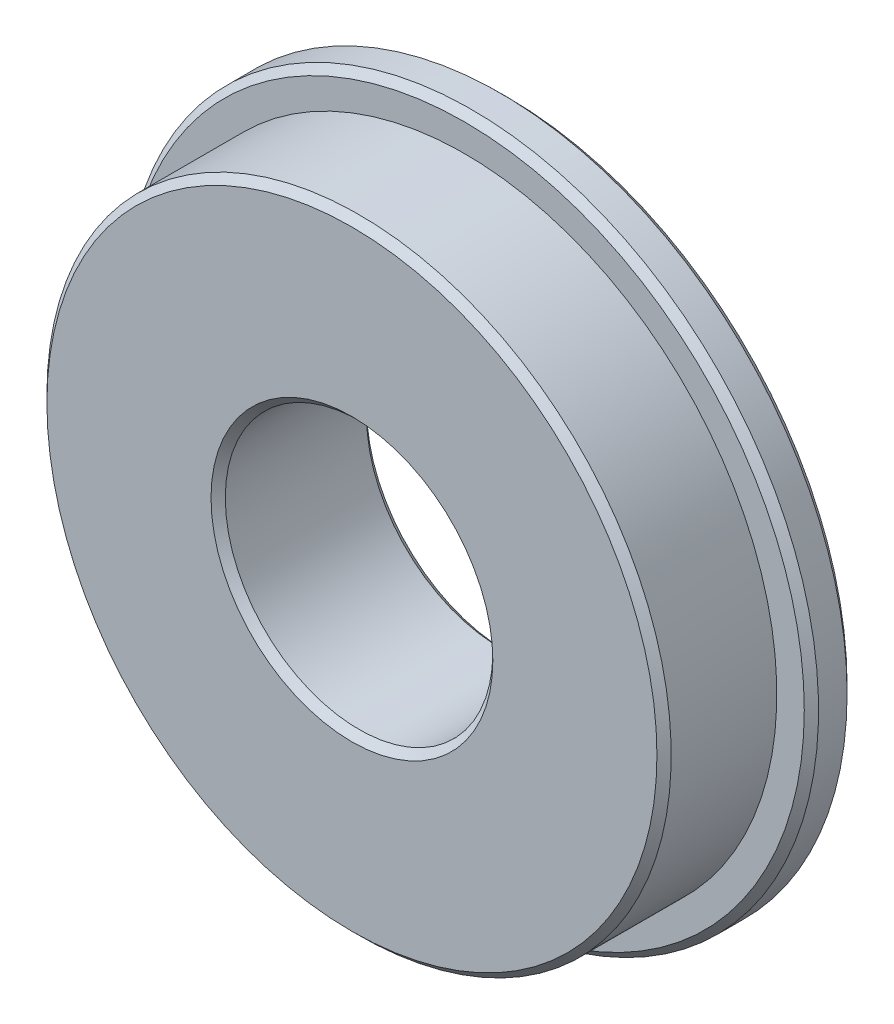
ISO-10303-21;
HEADER;
FILE_DESCRIPTION(('STEP AP214'),'2;1');
FILE_NAME('part.step','',(''),(''),'','','');
FILE_SCHEMA(('AUTOMOTIVE_DESIGN { 1 0 10303 214 1 1 1 1 }'));
ENDSEC;
DATA;
#1=APPLICATION_CONTEXT('core data for automotive mechanical design processes');
#2=APPLICATION_PROTOCOL_DEFINITION('international standard','automotive_design',2000,#1);
#3=PRODUCT_CONTEXT('',#1,'mechanical');
#4=PRODUCT('Part','Part','',(#3));
#5=PRODUCT_RELATED_PRODUCT_CATEGORY('part','',(#4));
#6=PRODUCT_DEFINITION_FORMATION('','',#4);
#7=PRODUCT_DEFINITION_CONTEXT('part definition',#1,'design');
#8=PRODUCT_DEFINITION('design','',#6,#7);
#9=PRODUCT_DEFINITION_SHAPE('','',#8);
#10=(LENGTH_UNIT() NAMED_UNIT(*) SI_UNIT(.MILLI.,.METRE.));
#11=(NAMED_UNIT(*) PLANE_ANGLE_UNIT() SI_UNIT($,.RADIAN.));
#12=(NAMED_UNIT(*) SI_UNIT($,.STERADIAN.) SOLID_ANGLE_UNIT());
#13=UNCERTAINTY_MEASURE_WITH_UNIT(LENGTH_MEASURE(1.E-05),#10,'distance_accuracy_value','');
#14=(GEOMETRIC_REPRESENTATION_CONTEXT(3) GLOBAL_UNCERTAINTY_ASSIGNED_CONTEXT((#13)) GLOBAL_UNIT_ASSIGNED_CONTEXT((#10,
#11,#12)) REPRESENTATION_CONTEXT('',''));
#15=CARTESIAN_POINT('',(0.,0.,0.));
#16=DIRECTION('',(0.,0.,1.));
#17=DIRECTION('',(1.,0.,0.));
#18=AXIS2_PLACEMENT_3D('',#15,#16,#17);
#19=CARTESIAN_POINT('',(-8.86153846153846,6.04195804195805,5.28319999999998));
#20=DIRECTION('',(0.,0.,-1.));
#21=DIRECTION('',(-1.,0.,0.));
#22=AXIS2_PLACEMENT_3D('',#19,#20,#21);
#23=CONICAL_SURFACE('',#22,11.1125,0.78539816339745);
#24=CARTESIAN_POINT('',(-8.86153846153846,6.04195804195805,5.2832));
#25=DIRECTION('',(0.,0.,-1.));
#26=DIRECTION('',(-1.,0.,0.));
#27=AXIS2_PLACEMENT_3D('',#24,#25,#26);
#28=CIRCLE('',#27,11.1125);
#29=CARTESIAN_POINT('',(-19.9740384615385,6.04195804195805,5.2832));
#30=VERTEX_POINT('',#29);
#31=EDGE_CURVE('E44',#30,#30,#28,.T.);
#32=ORIENTED_EDGE('',*,*,#31,.F.);
#33=EDGE_LOOP('',(#32));
#34=FACE_BOUND('',#33,.T.);
#35=CARTESIAN_POINT('',(-8.86153846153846,6.04195804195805,5.53719999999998));
#36=DIRECTION('',(0.,0.,-1.));
#37=DIRECTION('',(-1.,0.,0.));
#38=AXIS2_PLACEMENT_3D('',#35,#36,#37);
#39=CIRCLE('',#38,10.8585);
#40=CARTESIAN_POINT('',(-19.7200384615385,6.04195804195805,5.53719999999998));
#41=VERTEX_POINT('',#40);
#42=EDGE_CURVE('E18',#41,#41,#39,.T.);
#43=ORIENTED_EDGE('',*,*,#42,.T.);
#44=EDGE_LOOP('',(#43));
#45=FACE_BOUND('',#44,.T.);
#46=ADVANCED_FACE('F15',(#34,#45),#23,.T.);
#47=CARTESIAN_POINT('',(-8.86153846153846,6.04195804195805,5.5372));
#48=DIRECTION('',(0.,0.,-1.));
#49=DIRECTION('',(-1.,0.,0.));
#50=AXIS2_PLACEMENT_3D('',#47,#48,#49);
#51=CYLINDRICAL_SURFACE('',#50,11.1125);
#52=CARTESIAN_POINT('',(-8.86153846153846,6.04195804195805,1.524));
#53=DIRECTION('',(0.,0.,-1.));
#54=DIRECTION('',(-1.,0.,0.));
#55=AXIS2_PLACEMENT_3D('',#52,#53,#54);
#56=CIRCLE('',#55,11.1125);
#57=CARTESIAN_POINT('',(-19.9740384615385,6.04195804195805,1.524));
#58=VERTEX_POINT('',#57);
#59=EDGE_CURVE('E39',#58,#58,#56,.F.);
#60=ORIENTED_EDGE('',*,*,#59,.T.);
#61=EDGE_LOOP('',(#60));
#62=FACE_BOUND('',#61,.T.);
#63=ORIENTED_EDGE('',*,*,#31,.T.);
#64=EDGE_LOOP('',(#63));
#65=FACE_BOUND('',#64,.T.);
#66=ADVANCED_FACE('F147',(#62,#65),#51,.T.);
#67=CARTESIAN_POINT('',(-8.86153846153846,6.04195804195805,5.5372));
#68=DIRECTION('',(0.,0.,-1.));
#69=DIRECTION('',(-1.,0.,0.));
#70=AXIS2_PLACEMENT_3D('',#67,#68,#69);
#71=PLANE('',#70);
#72=ORIENTED_EDGE('',*,*,#42,.F.);
#73=EDGE_LOOP('',(#72));
#74=FACE_BOUND('',#73,.T.);
#75=CARTESIAN_POINT('',(-8.86153846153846,6.04195804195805,5.53719999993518));
#76=DIRECTION('',(0.,0.,1.));
#77=DIRECTION('',(1.,0.,0.));
#78=AXIS2_PLACEMENT_3D('',#75,#76,#77);
#79=CIRCLE('',#78,5.01650000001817);
#80=CARTESIAN_POINT('',(-3.84503846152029,6.04195804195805,5.53719999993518));
#81=VERTEX_POINT('',#80);
#82=EDGE_CURVE('E37',#81,#81,#79,.F.);
#83=ORIENTED_EDGE('',*,*,#82,.T.);
#84=EDGE_LOOP('',(#83));
#85=FACE_BOUND('',#84,.T.);
#86=ADVANCED_FACE('F139',(#74,#85),#71,.F.);
#87=CARTESIAN_POINT('',(-8.86153846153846,6.04195804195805,1.524));
#88=DIRECTION('',(0.,0.,-1.));
#89=DIRECTION('',(-1.,0.,0.));
#90=AXIS2_PLACEMENT_3D('',#87,#88,#89);
#91=PLANE('',#90);
#92=ORIENTED_EDGE('',*,*,#59,.F.);
#93=EDGE_LOOP('',(#92));
#94=FACE_BOUND('',#93,.T.);
#95=CARTESIAN_POINT('',(-8.86153846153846,6.04195804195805,1.52399999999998));
#96=DIRECTION('',(0.,0.,-1.));
#97=DIRECTION('',(-1.,0.,0.));
#98=AXIS2_PLACEMENT_3D('',#95,#96,#97);
#99=CIRCLE('',#98,12.0904);
#100=CARTESIAN_POINT('',(-20.9519384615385,6.04195804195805,1.52399999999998));
#101=VERTEX_POINT('',#100);
#102=EDGE_CURVE('E33',#101,#101,#99,.T.);
#103=ORIENTED_EDGE('',*,*,#102,.F.);
#104=EDGE_LOOP('',(#103));
#105=FACE_BOUND('',#104,.T.);
#106=ADVANCED_FACE('F131',(#94,#105),#91,.F.);
#107=CARTESIAN_POINT('',(-8.86153846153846,6.04195804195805,5.53719999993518));
#108=DIRECTION('',(0.,0.,1.));
#109=DIRECTION('',(1.,0.,0.));
#110=AXIS2_PLACEMENT_3D('',#107,#108,#109);
#111=CONICAL_SURFACE('',#110,5.01650000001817,0.785398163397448);
#112=ORIENTED_EDGE('',*,*,#82,.F.);
#113=EDGE_LOOP('',(#112));
#114=FACE_BOUND('',#113,.T.);
#115=CARTESIAN_POINT('',(-8.86153846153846,6.04195804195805,5.2832));
#116=DIRECTION('',(0.,0.,-1.));
#117=DIRECTION('',(-1.,0.,0.));
#118=AXIS2_PLACEMENT_3D('',#115,#116,#117);
#119=CIRCLE('',#118,4.7625);
#120=CARTESIAN_POINT('',(-13.6240384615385,6.04195804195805,5.2832));
#121=VERTEX_POINT('',#120);
#122=EDGE_CURVE('E36',#121,#121,#119,.T.);
#123=ORIENTED_EDGE('',*,*,#122,.T.);
#124=EDGE_LOOP('',(#123));
#125=FACE_BOUND('',#124,.T.);
#126=ADVANCED_FACE('F123',(#114,#125),#111,.F.);
#127=CARTESIAN_POINT('',(-8.86153846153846,6.04195804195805,1.26999999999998));
#128=DIRECTION('',(0.,0.,-1.));
#129=DIRECTION('',(-1.,0.,0.));
#130=AXIS2_PLACEMENT_3D('',#127,#128,#129);
#131=CONICAL_SURFACE('',#130,12.3444,0.785398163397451);
#132=CARTESIAN_POINT('',(-8.86153846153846,6.04195804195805,1.27));
#133=DIRECTION('',(0.,0.,-1.));
#134=DIRECTION('',(-1.,0.,0.));
#135=AXIS2_PLACEMENT_3D('',#132,#133,#134);
#136=CIRCLE('',#135,12.3444);
#137=CARTESIAN_POINT('',(-21.2059384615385,6.04195804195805,1.27));
#138=VERTEX_POINT('',#137);
#139=EDGE_CURVE('E55',#138,#138,#136,.T.);
#140=ORIENTED_EDGE('',*,*,#139,.F.);
#141=EDGE_LOOP('',(#140));
#142=FACE_BOUND('',#141,.T.);
#143=ORIENTED_EDGE('',*,*,#102,.T.);
#144=EDGE_LOOP('',(#143));
#145=FACE_BOUND('',#144,.T.);
#146=ADVANCED_FACE('F85',(#142,#145),#131,.T.);
#147=CARTESIAN_POINT('',(-8.86153846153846,6.04195804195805,1.524));
#148=DIRECTION('',(0.,0.,-1.));
#149=DIRECTION('',(-1.,0.,0.));
#150=AXIS2_PLACEMENT_3D('',#147,#148,#149);
#151=CYLINDRICAL_SURFACE('',#150,4.7625);
#152=ORIENTED_EDGE('',*,*,#122,.F.);
#153=EDGE_LOOP('',(#152));
#154=FACE_BOUND('',#153,.T.);
#155=CARTESIAN_POINT('',(-8.86153846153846,6.04195804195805,0.253999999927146));
#156=DIRECTION('',(0.,0.,-1.));
#157=DIRECTION('',(-1.,0.,0.));
#158=AXIS2_PLACEMENT_3D('',#155,#156,#157);
#159=CIRCLE('',#158,4.76249999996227);
#160=CARTESIAN_POINT('',(-13.6240384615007,6.04195804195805,0.253999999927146));
#161=VERTEX_POINT('',#160);
#162=EDGE_CURVE('E60',#161,#161,#159,.T.);
#163=ORIENTED_EDGE('',*,*,#162,.T.);
#164=EDGE_LOOP('',(#163));
#165=FACE_BOUND('',#164,.T.);
#166=ADVANCED_FACE('F75',(#154,#165),#151,.F.);
#167=CARTESIAN_POINT('',(-8.86153846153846,6.04195804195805,1.524));
#168=DIRECTION('',(0.,0.,-1.));
#169=DIRECTION('',(-1.,0.,0.));
#170=AXIS2_PLACEMENT_3D('',#167,#168,#169);
#171=CYLINDRICAL_SURFACE('',#170,12.3444);
#172=ORIENTED_EDGE('',*,*,#139,.T.);
#173=EDGE_LOOP('',(#172));
#174=FACE_BOUND('',#173,.T.);
#175=CARTESIAN_POINT('',(-8.86153846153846,6.04195804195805,0.25400000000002));
#176=DIRECTION('',(0.,0.,1.));
#177=DIRECTION('',(1.,0.,0.));
#178=AXIS2_PLACEMENT_3D('',#175,#176,#177);
#179=CIRCLE('',#178,12.3444);
#180=CARTESIAN_POINT('',(3.48286153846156,6.04195804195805,0.25400000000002));
#181=VERTEX_POINT('',#180);
#182=EDGE_CURVE('E27',#181,#181,#179,.F.);
#183=ORIENTED_EDGE('',*,*,#182,.F.);
#184=EDGE_LOOP('',(#183));
#185=FACE_BOUND('',#184,.T.);
#186=ADVANCED_FACE('F72',(#174,#185),#171,.T.);
#187=CARTESIAN_POINT('',(-8.86153846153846,6.04195804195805,-1.13686837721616E-10));
#188=DIRECTION('',(0.,0.,-1.));
#189=DIRECTION('',(-1.,0.,0.));
#190=AXIS2_PLACEMENT_3D('',#187,#188,#189);
#191=CONICAL_SURFACE('',#190,5.01650000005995,0.785398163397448);
#192=ORIENTED_EDGE('',*,*,#162,.F.);
#193=EDGE_LOOP('',(#192));
#194=FACE_BOUND('',#193,.T.);
#195=CARTESIAN_POINT('',(-8.86153846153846,6.04195804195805,-5.6843418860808E-11));
#196=DIRECTION('',(0.,0.,-1.));
#197=DIRECTION('',(-1.,0.,0.));
#198=AXIS2_PLACEMENT_3D('',#195,#196,#197);
#199=CIRCLE('',#198,5.0165000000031);
#200=CARTESIAN_POINT('',(-13.8780384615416,6.04195804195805,-5.6843418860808E-11));
#201=VERTEX_POINT('',#200);
#202=EDGE_CURVE('E22',#201,#201,#199,.F.);
#203=ORIENTED_EDGE('',*,*,#202,.F.);
#204=EDGE_LOOP('',(#203));
#205=FACE_BOUND('',#204,.T.);
#206=ADVANCED_FACE('F74',(#194,#205),#191,.F.);
#207=CARTESIAN_POINT('',(-8.86153846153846,6.04195804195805,0.254000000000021));
#208=DIRECTION('',(0.,0.,1.));
#209=DIRECTION('',(1.,0.,0.));
#210=AXIS2_PLACEMENT_3D('',#207,#208,#209);
#211=CONICAL_SURFACE('',#210,12.3444,0.785398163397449);
#212=CARTESIAN_POINT('',(-8.86153846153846,6.04195804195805,0.));
#213=DIRECTION('',(0.,0.,1.));
#214=DIRECTION('',(1.,0.,0.));
#215=AXIS2_PLACEMENT_3D('',#212,#213,#214);
#216=CIRCLE('',#215,12.0904);
#217=CARTESIAN_POINT('',(3.22886153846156,6.04195804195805,0.));
#218=VERTEX_POINT('',#217);
#219=EDGE_CURVE('E10',#218,#218,#216,.F.);
#220=ORIENTED_EDGE('',*,*,#219,.F.);
#221=EDGE_LOOP('',(#220));
#222=FACE_BOUND('',#221,.T.);
#223=ORIENTED_EDGE('',*,*,#182,.T.);
#224=EDGE_LOOP('',(#223));
#225=FACE_BOUND('',#224,.T.);
#226=ADVANCED_FACE('F70',(#222,#225),#211,.T.);
#227=CARTESIAN_POINT('',(-8.86153846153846,6.04195804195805,0.));
#228=DIRECTION('',(0.,0.,-1.));
#229=DIRECTION('',(-1.,0.,0.));
#230=AXIS2_PLACEMENT_3D('',#227,#228,#229);
#231=PLANE('',#230);
#232=ORIENTED_EDGE('',*,*,#219,.T.);
#233=EDGE_LOOP('',(#232));
#234=FACE_BOUND('',#233,.T.);
#235=ORIENTED_EDGE('',*,*,#202,.T.);
#236=EDGE_LOOP('',(#235));
#237=FACE_BOUND('',#236,.T.);
#238=ADVANCED_FACE('F88',(#234,#237),#231,.T.);
#239=CLOSED_SHELL('',(#46,#66,#86,#106,#126,#146,#166,#186,#206,#226,#238));
#240=MANIFOLD_SOLID_BREP('B1',#239);
#241=ADVANCED_BREP_SHAPE_REPRESENTATION('',(#18,#240),#14);
#242=SHAPE_DEFINITION_REPRESENTATION(#9,#241);
ENDSEC;
END-ISO-10303-21;
